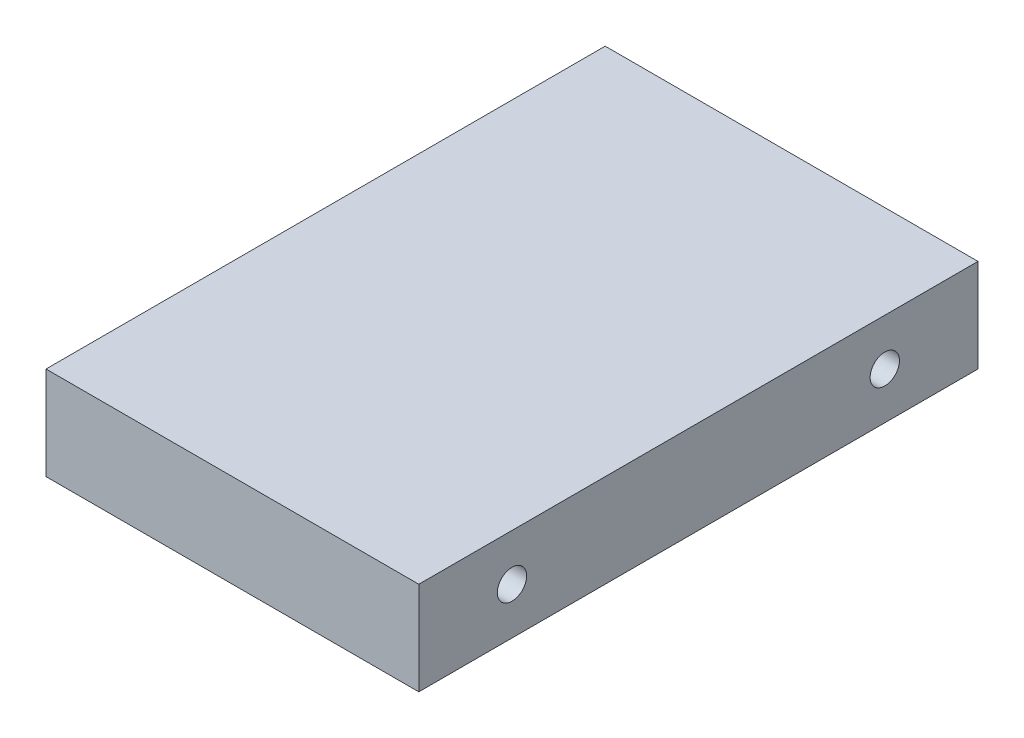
from build123d import *

# Parameters (mm, degrees)
SKETCH2_W                = 50.8
SKETCH2_H                = 76.2
BOSS_EXTRUDE1_DEPTH      = 12.7
F_4_0_4_DIAMETER_HOLE1_D = 4


with BuildPart() as part:
    # Sketch2 → Boss-Extrude1 (new body)
    with BuildSketch(Plane(origin=(0, 0, 0), x_dir=(1, 0, 0), z_dir=(0, 1, 0))):
        with Locations((-40.099689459, -21.990121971)):
            Rectangle(SKETCH2_W, SKETCH2_H)
    extrude(amount=BOSS_EXTRUDE1_DEPTH)

    # 4.0 _4_ Diameter Hole1 (through all)
    with Locations(Plane(origin=(-14.699689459, 6.35, -3.409878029), x_dir=(0, 0, 1), z_dir=(1, 0, 0))):
        with Locations((0, 0), (50.8, 0)):
            Hole(F_4_0_4_DIAMETER_HOLE1_D / 2)


solid = part.part
